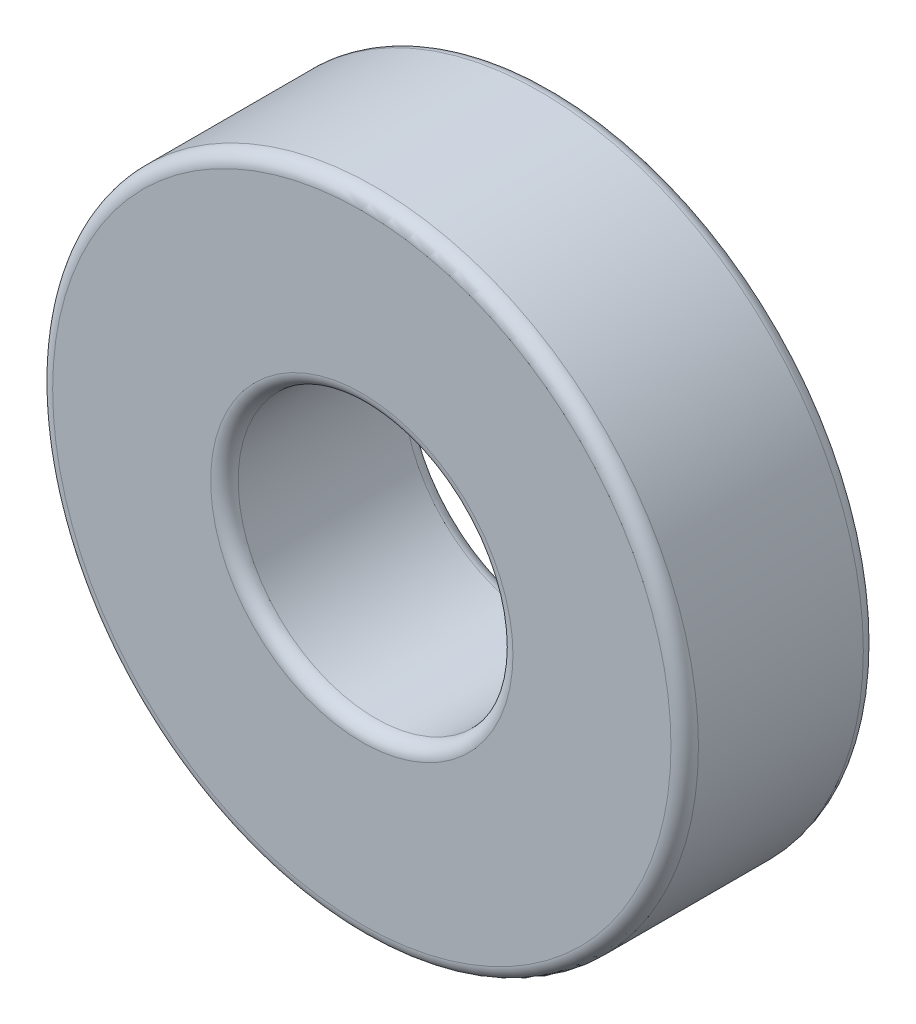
from build123d import *

# Parameters (mm, degrees)
ESQUISSE1_R      = 23.5
ESQUISSE1_R_2    = 10
EXTRUSION1_DEPTH = 14
CONG_1_R         = 1


with BuildPart() as part:
    # Esquisse1 → Extrusion1 (new body)
    with BuildSketch(Plane.XY):
        Circle(ESQUISSE1_R)
        Circle(ESQUISSE1_R_2, mode=Mode.SUBTRACT)
    extrude(amount=EXTRUSION1_DEPTH)

    # Cong_1
    cong_1_edges = [part.edges().sort_by_distance(p)[0] for p in [
        (-23.5, 0, 0),
        (-23.5, 0, 14),
        (-10, 0, 0),
        (-10, 0, 14),
    ]]
    fillet(cong_1_edges, radius=CONG_1_R)


solid = part.part
